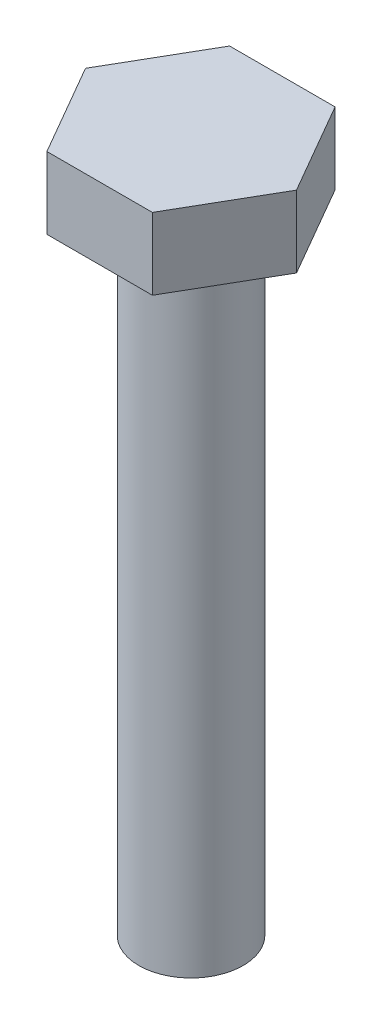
from build123d import *

# Parameters (mm, degrees)
SKETCH1_R           = 3.175
BOSS_EXTRUDE1_DEPTH = 38.1
BOSS_EXTRUDE2_DEPTH = 4.365625


with BuildPart() as part:
    # Sketch1 → Boss-Extrude1 (new body)
    with BuildSketch(Plane(origin=(0, 0, 0), x_dir=(1, 0, 0), z_dir=(0, 1, 0))):
        with Locations(Location((0, 0, 0), (0, 0, 270))):
            Circle(SKETCH1_R)
    extrude(amount=-BOSS_EXTRUDE1_DEPTH)

    # Sketch2 → Boss-Extrude2 (add)
    with BuildSketch(Plane(origin=(0, 0, 0), x_dir=(1, 0, 0), z_dir=(0, 1, 0))):
        Polygon((3.207902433, -5.55625), (6.415804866, 0), (3.207902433, 5.55625), (-3.207902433, 5.55625), (-6.415804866, 0), (-3.207902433, -5.55625), align=None)
    extrude(amount=BOSS_EXTRUDE2_DEPTH)


solid = part.part
